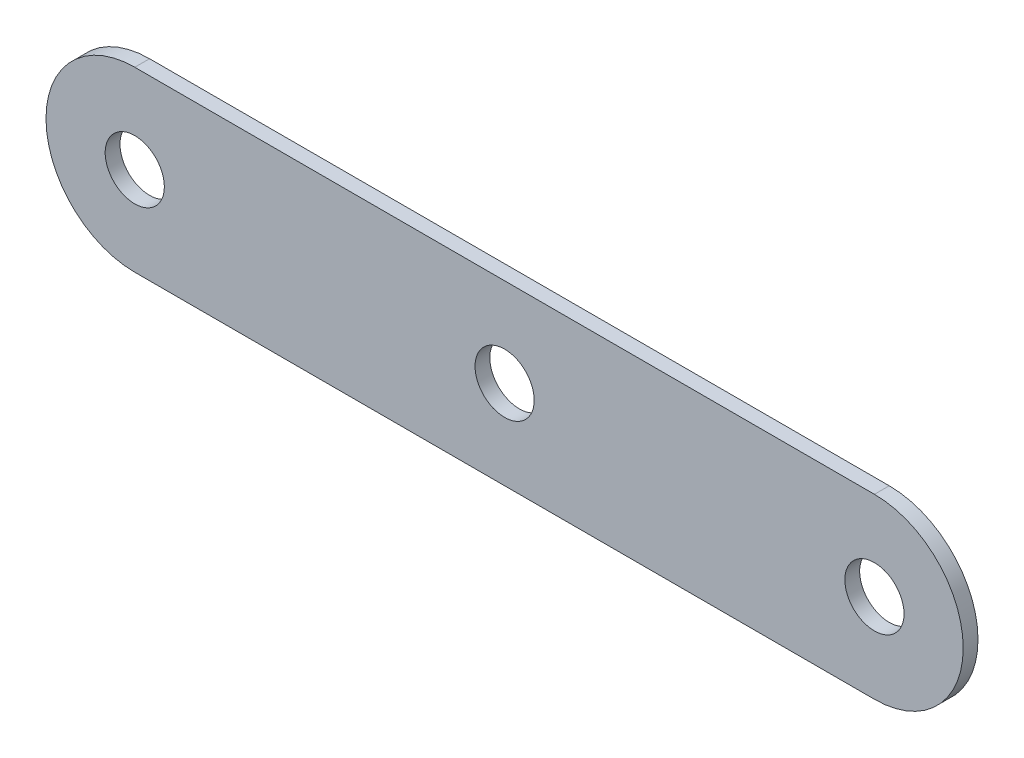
from build123d import *

# Parameters (mm, degrees)
SKETCH2_R           = 20
BOSS_EXTRUDE1_DEPTH = 5


with BuildPart() as part:
    # Sketch2 → Boss-Extrude1 (new, symmetric)
    with BuildSketch(Plane.XY):
        with BuildLine():
            Line((250, -60), (-250, -60))
            ThreePointArc((-250, -60), (-310, 0), (-250, 60))
            Line((-250, 60), (250, 60))
            ThreePointArc((250, 60), (310, 0), (250, -60))
        make_face()
        with Locations((-250, 0)):
            Circle(SKETCH2_R, mode=Mode.SUBTRACT)
        Circle(SKETCH2_R, mode=Mode.SUBTRACT)
        with Locations((250, 0)):
            Circle(SKETCH2_R, mode=Mode.SUBTRACT)
    extrude(amount=BOSS_EXTRUDE1_DEPTH, both=True)


solid = part.part
